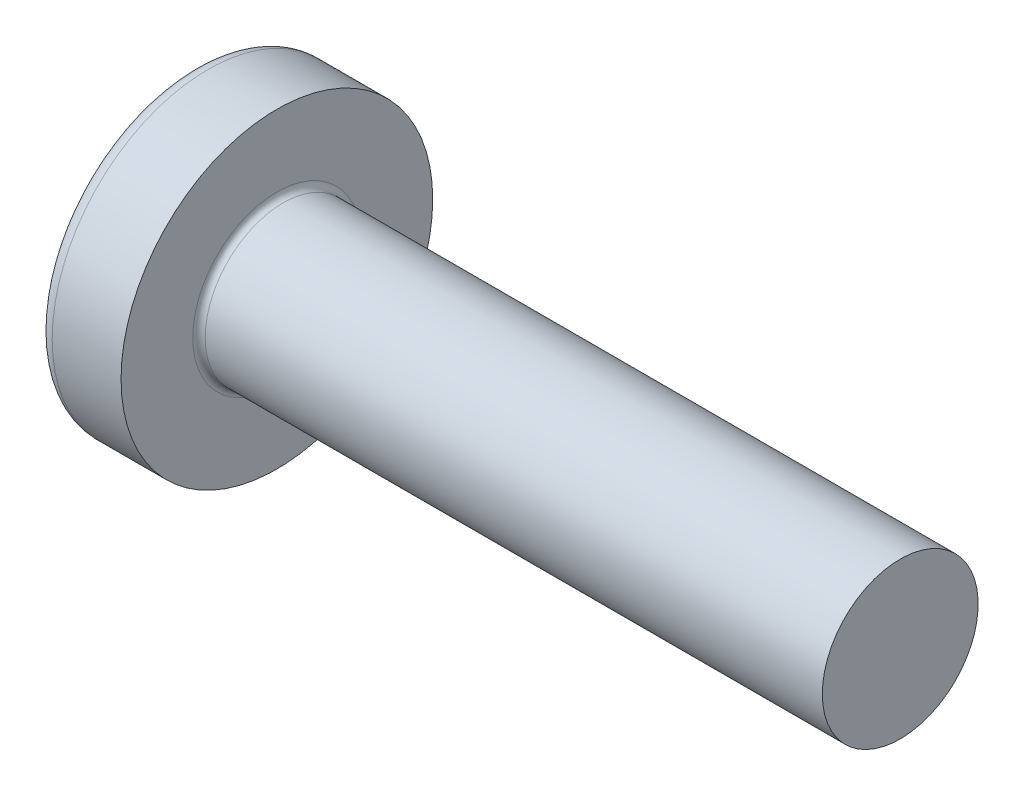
ISO-10303-21;
HEADER;
FILE_DESCRIPTION(('STEP AP214'),'2;1');
FILE_NAME('part.step','',(''),(''),'','','');
FILE_SCHEMA(('AUTOMOTIVE_DESIGN { 1 0 10303 214 1 1 1 1 }'));
ENDSEC;
DATA;
#1=APPLICATION_CONTEXT('core data for automotive mechanical design processes');
#2=APPLICATION_PROTOCOL_DEFINITION('international standard','automotive_design',2000,#1);
#3=PRODUCT_CONTEXT('',#1,'mechanical');
#4=PRODUCT('Part','Part','',(#3));
#5=PRODUCT_RELATED_PRODUCT_CATEGORY('part','',(#4));
#6=PRODUCT_DEFINITION_FORMATION('','',#4);
#7=PRODUCT_DEFINITION_CONTEXT('part definition',#1,'design');
#8=PRODUCT_DEFINITION('design','',#6,#7);
#9=PRODUCT_DEFINITION_SHAPE('','',#8);
#10=(LENGTH_UNIT() NAMED_UNIT(*) SI_UNIT(.MILLI.,.METRE.));
#11=(NAMED_UNIT(*) PLANE_ANGLE_UNIT() SI_UNIT($,.RADIAN.));
#12=(NAMED_UNIT(*) SI_UNIT($,.STERADIAN.) SOLID_ANGLE_UNIT());
#13=UNCERTAINTY_MEASURE_WITH_UNIT(LENGTH_MEASURE(1.E-05),#10,'distance_accuracy_value','');
#14=(GEOMETRIC_REPRESENTATION_CONTEXT(3) GLOBAL_UNCERTAINTY_ASSIGNED_CONTEXT((#13)) GLOBAL_UNIT_ASSIGNED_CONTEXT((#10,
#11,#12)) REPRESENTATION_CONTEXT('',''));
#15=CARTESIAN_POINT('',(0.,0.,0.));
#16=DIRECTION('',(0.,0.,1.));
#17=DIRECTION('',(1.,0.,0.));
#18=AXIS2_PLACEMENT_3D('',#15,#16,#17);
#19=CARTESIAN_POINT('',(4.,0.,0.));
#20=DIRECTION('',(-1.,0.,0.));
#21=DIRECTION('',(0.,1.,0.));
#22=AXIS2_PLACEMENT_3D('',#19,#20,#21);
#23=SPHERICAL_SURFACE('',#22,4.);
#24=CARTESIAN_POINT('',(0.803195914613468,0.,0.));
#25=DIRECTION('',(-1.,0.,0.));
#26=DIRECTION('',(0.,0.,1.));
#27=AXIS2_PLACEMENT_3D('',#24,#25,#26);
#28=CIRCLE('',#27,2.40425531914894);
#29=CARTESIAN_POINT('',(0.803195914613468,0.,2.40425531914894));
#30=VERTEX_POINT('',#29);
#31=EDGE_CURVE('E230',#30,#30,#28,.T.);
#32=ORIENTED_EDGE('',*,*,#31,.T.);
#33=EDGE_LOOP('',(#32));
#34=FACE_BOUND('',#33,.T.);
#35=CARTESIAN_POINT('',(0.0543400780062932,0.,0.));
#36=DIRECTION('',(1.,0.,0.));
#37=DIRECTION('',(0.,0.,-1.));
#38=AXIS2_PLACEMENT_3D('',#35,#36,#37);
#39=CIRCLE('',#38,0.657090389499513);
#40=CARTESIAN_POINT('',(0.0543400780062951,-0.369999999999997,-0.54301729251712));
#41=VERTEX_POINT('',#40);
#42=CARTESIAN_POINT('',(0.0543400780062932,-0.543017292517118,-0.37));
#43=VERTEX_POINT('',#42);
#44=EDGE_CURVE('E445',#41,#43,#39,.F.);
#45=ORIENTED_EDGE('',*,*,#44,.F.);
#46=CARTESIAN_POINT('',(4.,-0.37,0.));
#47=DIRECTION('',(0.,1.,0.));
#48=DIRECTION('',(0.,0.,1.));
#49=AXIS2_PLACEMENT_3D('',#46,#47,#48);
#50=CIRCLE('',#49,3.98285073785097);
#51=CARTESIAN_POINT('',(0.201999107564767,-0.369999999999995,-1.19928696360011));
#52=VERTEX_POINT('',#51);
#53=EDGE_CURVE('E277',#52,#41,#50,.T.);
#54=ORIENTED_EDGE('',*,*,#53,.F.);
#55=CARTESIAN_POINT('',(3.72274316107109,0.,0.556091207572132));
#56=DIRECTION('',(0.446197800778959,0.,-0.89493436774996));
#57=DIRECTION('',(-0.89493436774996,0.,-0.446197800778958));
#58=AXIS2_PLACEMENT_3D('',#55,#56,#57);
#59=CIRCLE('',#58,3.95144166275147);
#60=CARTESIAN_POINT('',(0.20199910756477,0.370000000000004,-1.19928696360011));
#61=VERTEX_POINT('',#60);
#62=EDGE_CURVE('E249',#52,#61,#59,.T.);
#63=ORIENTED_EDGE('',*,*,#62,.T.);
#64=CARTESIAN_POINT('',(4.,0.37,0.));
#65=DIRECTION('',(0.,-1.,0.));
#66=DIRECTION('',(0.,0.,-1.));
#67=AXIS2_PLACEMENT_3D('',#64,#65,#66);
#68=CIRCLE('',#67,3.98285073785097);
#69=CARTESIAN_POINT('',(0.0543400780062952,0.370000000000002,-0.543017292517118));
#70=VERTEX_POINT('',#69);
#71=EDGE_CURVE('E285',#70,#61,#68,.T.);
#72=ORIENTED_EDGE('',*,*,#71,.F.);
#73=CARTESIAN_POINT('',(0.0543400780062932,0.543017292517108,-0.37));
#74=VERTEX_POINT('',#73);
#75=EDGE_CURVE('E358',#74,#70,#39,.F.);
#76=ORIENTED_EDGE('',*,*,#75,.F.);
#77=CARTESIAN_POINT('',(4.,0.,-0.37));
#78=DIRECTION('',(0.,0.,1.));
#79=DIRECTION('',(0.,-1.,0.));
#80=AXIS2_PLACEMENT_3D('',#77,#78,#79);
#81=CIRCLE('',#80,3.98285073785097);
#82=CARTESIAN_POINT('',(0.201999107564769,1.19928696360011,-0.37));
#83=VERTEX_POINT('',#82);
#84=EDGE_CURVE('E243',#83,#74,#81,.T.);
#85=ORIENTED_EDGE('',*,*,#84,.F.);
#86=CARTESIAN_POINT('',(3.72274316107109,-0.556091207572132,0.));
#87=DIRECTION('',(0.446197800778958,0.89493436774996,0.));
#88=DIRECTION('',(-0.89493436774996,0.446197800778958,0.));
#89=AXIS2_PLACEMENT_3D('',#86,#87,#88);
#90=CIRCLE('',#89,3.95144166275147);
#91=CARTESIAN_POINT('',(0.201999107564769,1.19928696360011,0.369999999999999));
#92=VERTEX_POINT('',#91);
#93=EDGE_CURVE('E246',#83,#92,#90,.T.);
#94=ORIENTED_EDGE('',*,*,#93,.T.);
#95=CARTESIAN_POINT('',(4.,0.,0.37));
#96=DIRECTION('',(0.,0.,-1.));
#97=DIRECTION('',(0.,1.,0.));
#98=AXIS2_PLACEMENT_3D('',#95,#96,#97);
#99=CIRCLE('',#98,3.98285073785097);
#100=CARTESIAN_POINT('',(0.0543400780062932,0.543017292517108,0.37));
#101=VERTEX_POINT('',#100);
#102=EDGE_CURVE('E239',#101,#92,#99,.T.);
#103=ORIENTED_EDGE('',*,*,#102,.F.);
#104=CARTESIAN_POINT('',(0.0543400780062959,0.369999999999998,0.54301729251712));
#105=VERTEX_POINT('',#104);
#106=EDGE_CURVE('E391',#105,#101,#39,.F.);
#107=ORIENTED_EDGE('',*,*,#106,.F.);
#108=CARTESIAN_POINT('',(0.201999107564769,0.369999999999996,1.19928696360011));
#109=VERTEX_POINT('',#108);
#110=EDGE_CURVE('E259',#109,#105,#68,.T.);
#111=ORIENTED_EDGE('',*,*,#110,.F.);
#112=CARTESIAN_POINT('',(3.72274316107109,0.,-0.556091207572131));
#113=DIRECTION('',(0.446197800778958,0.,0.89493436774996));
#114=DIRECTION('',(0.89493436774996,0.,-0.446197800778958));
#115=AXIS2_PLACEMENT_3D('',#112,#113,#114);
#116=CIRCLE('',#115,3.95144166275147);
#117=CARTESIAN_POINT('',(0.201999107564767,-0.370000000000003,1.19928696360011));
#118=VERTEX_POINT('',#117);
#119=EDGE_CURVE('E41',#109,#118,#116,.T.);
#120=ORIENTED_EDGE('',*,*,#119,.T.);
#121=CARTESIAN_POINT('',(0.0543400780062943,-0.370000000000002,0.543017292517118));
#122=VERTEX_POINT('',#121);
#123=EDGE_CURVE('E256',#122,#118,#50,.T.);
#124=ORIENTED_EDGE('',*,*,#123,.F.);
#125=CARTESIAN_POINT('',(0.0543400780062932,-0.543017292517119,0.369999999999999));
#126=VERTEX_POINT('',#125);
#127=EDGE_CURVE('E430',#126,#122,#39,.F.);
#128=ORIENTED_EDGE('',*,*,#127,.F.);
#129=CARTESIAN_POINT('',(0.201999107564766,-1.19928696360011,0.369999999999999));
#130=VERTEX_POINT('',#129);
#131=EDGE_CURVE('E240',#130,#126,#99,.T.);
#132=ORIENTED_EDGE('',*,*,#131,.F.);
#133=CARTESIAN_POINT('',(3.72274316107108,0.556091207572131,0.));
#134=DIRECTION('',(0.446197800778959,-0.89493436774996,0.));
#135=DIRECTION('',(0.89493436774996,0.446197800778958,0.));
#136=AXIS2_PLACEMENT_3D('',#133,#134,#135);
#137=CIRCLE('',#136,3.95144166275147);
#138=CARTESIAN_POINT('',(0.201999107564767,-1.19928696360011,-0.37));
#139=VERTEX_POINT('',#138);
#140=EDGE_CURVE('E236',#130,#139,#137,.T.);
#141=ORIENTED_EDGE('',*,*,#140,.T.);
#142=EDGE_CURVE('E56',#43,#139,#81,.T.);
#143=ORIENTED_EDGE('',*,*,#142,.F.);
#144=EDGE_LOOP('',(#45,#54,#63,#72,#76,#85,#94,#103,#107,#111,#120,#124,#128,#132,#141,#143));
#145=FACE_BOUND('',#144,.T.);
#146=ADVANCED_FACE('F28',(#34,#145),#23,.T.);
#147=CARTESIAN_POINT('',(1.5,0.552127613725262,-0.37));
#148=DIRECTION('',(0.,0.,1.));
#149=DIRECTION('',(0.,-1.,0.));
#150=AXIS2_PLACEMENT_3D('',#147,#148,#149);
#151=PLANE('',#150);
#152=ORIENTED_EDGE('',*,*,#84,.T.);
#153=CARTESIAN_POINT('',(-0.984107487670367,0.628943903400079,-0.37));
#154=CARTESIAN_POINT('',(-0.783603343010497,0.61266994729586,-0.37));
#155=CARTESIAN_POINT('',(-0.583110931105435,0.596248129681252,-0.37));
#156=CARTESIAN_POINT('',(-0.182155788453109,0.562989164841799,-0.37));
#157=CARTESIAN_POINT('',(0.018306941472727,0.546152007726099,-0.37));
#158=CARTESIAN_POINT('',(0.419186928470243,0.511943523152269,-0.37));
#159=CARTESIAN_POINT('',(0.619604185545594,0.494572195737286,-0.37));
#160=CARTESIAN_POINT('',(1.02037173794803,0.459102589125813,-0.37));
#161=CARTESIAN_POINT('',(1.2207220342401,0.441004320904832,-0.37));
#162=CARTESIAN_POINT('',(1.53631168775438,0.411665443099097,-0.37));
#163=CARTESIAN_POINT('',(1.65158348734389,0.400774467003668,-0.37));
#164=CARTESIAN_POINT('',(1.88208360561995,0.378547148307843,-0.37));
#165=CARTESIAN_POINT('',(1.99731192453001,0.367210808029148,-0.37));
#166=CARTESIAN_POINT('',(2.22771614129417,0.343963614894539,-0.37));
#167=CARTESIAN_POINT('',(2.34289203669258,0.332052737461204,-0.37));
#168=CARTESIAN_POINT('',(2.57315819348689,0.307413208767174,-0.37));
#169=CARTESIAN_POINT('',(2.68824845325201,0.294684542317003,-0.37));
#170=CARTESIAN_POINT('',(2.80327961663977,0.281425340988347,-0.37));
#171=B_SPLINE_CURVE_WITH_KNOTS('',3,(#153,#154,#155,#156,#157,#158,#159,#160,#161,#162,#163,
#164,#165,#166,#167,#168,#169,#170),.UNSPECIFIED.,.F.,.F.,(4,2,2,2,2,2,2,2,4),(0.,
0.603490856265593,1.20699609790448,1.81050129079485,2.41399737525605,2.76135214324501,
3.1087051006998,3.45607293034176,3.80344721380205),.UNSPECIFIED.);
#172=CARTESIAN_POINT('',(1.5,0.415013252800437,-0.370000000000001));
#173=VERTEX_POINT('',#172);
#174=EDGE_CURVE('E351',#74,#173,#171,.T.);
#175=ORIENTED_EDGE('',*,*,#174,.T.);
#176=DIRECTION('',(0.,1.,0.));
#177=VECTOR('',#176,1.);
#178=CARTESIAN_POINT('',(1.5,-0.552127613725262,-0.37));
#179=LINE('',#178,#177);
#180=CARTESIAN_POINT('',(1.5,0.552127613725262,-0.37));
#181=VERTEX_POINT('',#180);
#182=EDGE_CURVE('E302',#173,#181,#179,.T.);
#183=ORIENTED_EDGE('',*,*,#182,.T.);
#184=DIRECTION('',(0.89493436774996,-0.446197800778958,0.));
#185=VECTOR('',#184,1.);
#186=CARTESIAN_POINT('',(0.,1.3,-0.37));
#187=LINE('',#186,#185);
#188=EDGE_CURVE('E308',#83,#181,#187,.T.);
#189=ORIENTED_EDGE('',*,*,#188,.F.);
#190=EDGE_LOOP('',(#152,#175,#183,#189));
#191=FACE_BOUND('',#190,.T.);
#192=ADVANCED_FACE('F186',(#191),#151,.T.);
#193=CARTESIAN_POINT('',(1.5,-0.552127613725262,-0.37));
#194=VERTEX_POINT('',#193);
#195=CARTESIAN_POINT('',(1.5,-0.415013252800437,-0.370000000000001));
#196=VERTEX_POINT('',#195);
#197=EDGE_CURVE('E299',#194,#196,#179,.T.);
#198=ORIENTED_EDGE('',*,*,#197,.T.);
#199=CARTESIAN_POINT('',(-0.984107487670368,-0.62894390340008,-0.37));
#200=CARTESIAN_POINT('',(-0.783603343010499,-0.61266994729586,-0.37));
#201=CARTESIAN_POINT('',(-0.583110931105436,-0.596248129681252,-0.37));
#202=CARTESIAN_POINT('',(-0.18215578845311,-0.562989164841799,-0.37));
#203=CARTESIAN_POINT('',(0.0183069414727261,-0.546152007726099,-0.37));
#204=CARTESIAN_POINT('',(0.419186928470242,-0.511943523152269,-0.37));
#205=CARTESIAN_POINT('',(0.619604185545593,-0.494572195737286,-0.37));
#206=CARTESIAN_POINT('',(1.02037173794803,-0.459102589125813,-0.37));
#207=CARTESIAN_POINT('',(1.22072203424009,-0.441004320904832,-0.37));
#208=CARTESIAN_POINT('',(1.53631168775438,-0.411665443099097,-0.37));
#209=CARTESIAN_POINT('',(1.65158348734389,-0.400774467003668,-0.37));
#210=CARTESIAN_POINT('',(1.88208360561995,-0.378547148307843,-0.37));
#211=CARTESIAN_POINT('',(1.99731192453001,-0.367210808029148,-0.37));
#212=CARTESIAN_POINT('',(2.22771614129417,-0.343963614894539,-0.37));
#213=CARTESIAN_POINT('',(2.34289203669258,-0.332052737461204,-0.37));
#214=CARTESIAN_POINT('',(2.57315819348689,-0.307413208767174,-0.37));
#215=CARTESIAN_POINT('',(2.68824845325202,-0.294684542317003,-0.37));
#216=CARTESIAN_POINT('',(2.80327961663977,-0.281425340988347,-0.37));
#217=B_SPLINE_CURVE_WITH_KNOTS('',3,(#199,#200,#201,#202,#203,#204,#205,#206,#207,#208,#209,
#210,#211,#212,#213,#214,#215,#216),.UNSPECIFIED.,.F.,.F.,(4,2,2,2,2,2,2,2,4),(0.,
0.603490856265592,1.20699609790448,1.81050129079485,2.41399737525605,2.76135214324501,
3.1087051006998,3.45607293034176,3.80344721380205),.UNSPECIFIED.);
#218=EDGE_CURVE('E344',#196,#43,#217,.F.);
#219=ORIENTED_EDGE('',*,*,#218,.T.);
#220=ORIENTED_EDGE('',*,*,#142,.T.);
#221=DIRECTION('',(0.89493436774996,0.446197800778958,0.));
#222=VECTOR('',#221,1.);
#223=CARTESIAN_POINT('',(0.,-1.3,-0.37));
#224=LINE('',#223,#222);
#225=EDGE_CURVE('E305',#139,#194,#224,.T.);
#226=ORIENTED_EDGE('',*,*,#225,.T.);
#227=EDGE_LOOP('',(#198,#219,#220,#226));
#228=FACE_BOUND('',#227,.T.);
#229=ADVANCED_FACE('F193',(#228),#151,.T.);
#230=CARTESIAN_POINT('',(1.5,-0.552127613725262,0.369999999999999));
#231=DIRECTION('',(0.,0.,-1.));
#232=DIRECTION('',(0.,1.,0.));
#233=AXIS2_PLACEMENT_3D('',#230,#231,#232);
#234=PLANE('',#233);
#235=DIRECTION('',(0.,-1.,0.));
#236=VECTOR('',#235,1.);
#237=CARTESIAN_POINT('',(1.5,0.552127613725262,0.37));
#238=LINE('',#237,#236);
#239=CARTESIAN_POINT('',(1.5,0.552127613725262,0.37));
#240=VERTEX_POINT('',#239);
#241=CARTESIAN_POINT('',(1.5,0.415013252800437,0.370000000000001));
#242=VERTEX_POINT('',#241);
#243=EDGE_CURVE('E291',#240,#242,#238,.T.);
#244=ORIENTED_EDGE('',*,*,#243,.T.);
#245=CARTESIAN_POINT('',(-0.984107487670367,0.62894390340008,0.37));
#246=CARTESIAN_POINT('',(-0.783603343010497,0.61266994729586,0.37));
#247=CARTESIAN_POINT('',(-0.583110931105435,0.596248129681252,0.37));
#248=CARTESIAN_POINT('',(-0.182155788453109,0.562989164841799,0.37));
#249=CARTESIAN_POINT('',(0.0183069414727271,0.546152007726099,0.37));
#250=CARTESIAN_POINT('',(0.419186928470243,0.511943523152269,0.37));
#251=CARTESIAN_POINT('',(0.619604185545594,0.494572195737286,0.37));
#252=CARTESIAN_POINT('',(1.02037173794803,0.459102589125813,0.37));
#253=CARTESIAN_POINT('',(1.2207220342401,0.441004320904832,0.37));
#254=CARTESIAN_POINT('',(1.53631168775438,0.411665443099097,0.37));
#255=CARTESIAN_POINT('',(1.65158348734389,0.400774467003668,0.37));
#256=CARTESIAN_POINT('',(1.88208360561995,0.378547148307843,0.37));
#257=CARTESIAN_POINT('',(1.99731192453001,0.367210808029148,0.37));
#258=CARTESIAN_POINT('',(2.22771614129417,0.343963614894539,0.37));
#259=CARTESIAN_POINT('',(2.34289203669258,0.332052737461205,0.37));
#260=CARTESIAN_POINT('',(2.57315819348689,0.307413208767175,0.37));
#261=CARTESIAN_POINT('',(2.68824845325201,0.294684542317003,0.37));
#262=CARTESIAN_POINT('',(2.80327961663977,0.281425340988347,0.37));
#263=B_SPLINE_CURVE_WITH_KNOTS('',3,(#245,#246,#247,#248,#249,#250,#251,#252,#253,#254,#255,
#256,#257,#258,#259,#260,#261,#262),.UNSPECIFIED.,.F.,.F.,(4,2,2,2,2,2,2,2,4),(0.,
0.603490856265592,1.20699609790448,1.81050129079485,2.41399737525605,2.76135214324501,
3.1087051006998,3.45607293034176,3.80344721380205),.UNSPECIFIED.);
#264=EDGE_CURVE('E392',#242,#101,#263,.F.);
#265=ORIENTED_EDGE('',*,*,#264,.T.);
#266=ORIENTED_EDGE('',*,*,#102,.T.);
#267=DIRECTION('',(0.89493436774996,-0.446197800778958,0.));
#268=VECTOR('',#267,1.);
#269=CARTESIAN_POINT('',(0.,1.3,0.37));
#270=LINE('',#269,#268);
#271=EDGE_CURVE('E307',#92,#240,#270,.T.);
#272=ORIENTED_EDGE('',*,*,#271,.T.);
#273=EDGE_LOOP('',(#244,#265,#266,#272));
#274=FACE_BOUND('',#273,.T.);
#275=ADVANCED_FACE('F339',(#274),#234,.T.);
#276=ORIENTED_EDGE('',*,*,#131,.T.);
#277=CARTESIAN_POINT('',(-0.984107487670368,-0.62894390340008,0.369999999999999));
#278=CARTESIAN_POINT('',(-0.783603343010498,-0.612669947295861,0.369999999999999));
#279=CARTESIAN_POINT('',(-0.583110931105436,-0.596248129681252,0.369999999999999));
#280=CARTESIAN_POINT('',(-0.18215578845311,-0.562989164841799,0.369999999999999));
#281=CARTESIAN_POINT('',(0.0183069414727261,-0.5461520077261,0.369999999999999));
#282=CARTESIAN_POINT('',(0.419186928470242,-0.511943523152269,0.369999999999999));
#283=CARTESIAN_POINT('',(0.619604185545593,-0.494572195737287,0.369999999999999));
#284=CARTESIAN_POINT('',(1.02037173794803,-0.459102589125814,0.369999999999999));
#285=CARTESIAN_POINT('',(1.22072203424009,-0.441004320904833,0.369999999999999));
#286=CARTESIAN_POINT('',(1.53631168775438,-0.411665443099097,0.369999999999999));
#287=CARTESIAN_POINT('',(1.65158348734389,-0.400774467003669,0.37));
#288=CARTESIAN_POINT('',(1.88208360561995,-0.378547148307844,0.37));
#289=CARTESIAN_POINT('',(1.99731192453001,-0.367210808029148,0.37));
#290=CARTESIAN_POINT('',(2.22771614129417,-0.34396361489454,0.37));
#291=CARTESIAN_POINT('',(2.34289203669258,-0.332052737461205,0.37));
#292=CARTESIAN_POINT('',(2.57315819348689,-0.307413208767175,0.37));
#293=CARTESIAN_POINT('',(2.68824845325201,-0.294684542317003,0.37));
#294=CARTESIAN_POINT('',(2.80327961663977,-0.281425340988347,0.37));
#295=B_SPLINE_CURVE_WITH_KNOTS('',3,(#277,#278,#279,#280,#281,#282,#283,#284,#285,#286,#287,
#288,#289,#290,#291,#292,#293,#294),.UNSPECIFIED.,.F.,.F.,(4,2,2,2,2,2,2,2,4),(0.,
0.603490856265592,1.20699609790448,1.81050129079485,2.41399737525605,2.76135214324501,
3.1087051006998,3.45607293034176,3.80344721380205),.UNSPECIFIED.);
#296=CARTESIAN_POINT('',(1.5,-0.415013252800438,0.37));
#297=VERTEX_POINT('',#296);
#298=EDGE_CURVE('E382',#126,#297,#295,.T.);
#299=ORIENTED_EDGE('',*,*,#298,.T.);
#300=CARTESIAN_POINT('',(1.5,-0.552127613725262,0.369999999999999));
#301=VERTEX_POINT('',#300);
#302=EDGE_CURVE('E294',#297,#301,#238,.T.);
#303=ORIENTED_EDGE('',*,*,#302,.T.);
#304=DIRECTION('',(0.89493436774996,0.446197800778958,0.));
#305=VECTOR('',#304,1.);
#306=CARTESIAN_POINT('',(0.,-1.3,0.369999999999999));
#307=LINE('',#306,#305);
#308=EDGE_CURVE('E289',#130,#301,#307,.T.);
#309=ORIENTED_EDGE('',*,*,#308,.F.);
#310=EDGE_LOOP('',(#276,#299,#303,#309));
#311=FACE_BOUND('',#310,.T.);
#312=ADVANCED_FACE('F335',(#311),#234,.T.);
#313=CARTESIAN_POINT('',(1.5,0.552127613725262,0.37));
#314=DIRECTION('',(0.446197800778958,0.89493436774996,0.));
#315=DIRECTION('',(-0.89493436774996,0.446197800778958,0.));
#316=AXIS2_PLACEMENT_3D('',#313,#314,#315);
#317=PLANE('',#316);
#318=CARTESIAN_POINT('',(2.47007520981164,0.0684659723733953,0.));
#319=DIRECTION('',(0.446197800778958,0.89493436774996,0.));
#320=DIRECTION('',(-0.89493436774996,0.446197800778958,0.));
#321=AXIS2_PLACEMENT_3D('',#318,#319,#320);
#322=ELLIPSE('',#321,1.09405678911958,0.483340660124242);
#323=CARTESIAN_POINT('',(1.5,0.552127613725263,0.0655064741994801));
#324=VERTEX_POINT('',#323);
#325=CARTESIAN_POINT('',(1.5,0.552127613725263,-0.0655064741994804));
#326=VERTEX_POINT('',#325);
#327=EDGE_CURVE('E422',#324,#326,#322,.F.);
#328=ORIENTED_EDGE('',*,*,#327,.F.);
#329=DIRECTION('',(0.,0.,-1.));
#330=VECTOR('',#329,1.);
#331=CARTESIAN_POINT('',(1.5,0.552127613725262,0.37));
#332=LINE('',#331,#330);
#333=EDGE_CURVE('E295',#240,#324,#332,.T.);
#334=ORIENTED_EDGE('',*,*,#333,.F.);
#335=ORIENTED_EDGE('',*,*,#271,.F.);
#336=ORIENTED_EDGE('',*,*,#93,.F.);
#337=ORIENTED_EDGE('',*,*,#188,.T.);
#338=EDGE_CURVE('E298',#326,#181,#332,.T.);
#339=ORIENTED_EDGE('',*,*,#338,.F.);
#340=EDGE_LOOP('',(#328,#334,#335,#336,#337,#339));
#341=FACE_BOUND('',#340,.T.);
#342=ADVANCED_FACE('F332',(#341),#317,.F.);
#343=CARTESIAN_POINT('',(0.,-1.3,-0.37));
#344=DIRECTION('',(0.446197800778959,-0.89493436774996,0.));
#345=DIRECTION('',(0.89493436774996,0.446197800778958,0.));
#346=AXIS2_PLACEMENT_3D('',#343,#344,#345);
#347=PLANE('',#346);
#348=CARTESIAN_POINT('',(2.47007520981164,-0.0684659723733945,0.));
#349=DIRECTION('',(0.446197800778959,-0.89493436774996,0.));
#350=DIRECTION('',(-0.89493436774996,-0.446197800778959,0.));
#351=AXIS2_PLACEMENT_3D('',#348,#349,#350);
#352=ELLIPSE('',#351,1.09405678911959,0.483340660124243);
#353=CARTESIAN_POINT('',(1.5,-0.552127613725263,-0.0655064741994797));
#354=VERTEX_POINT('',#353);
#355=CARTESIAN_POINT('',(1.5,-0.552127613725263,0.0655064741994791));
#356=VERTEX_POINT('',#355);
#357=EDGE_CURVE('E418',#354,#356,#352,.F.);
#358=ORIENTED_EDGE('',*,*,#357,.F.);
#359=DIRECTION('',(0.,0.,1.));
#360=VECTOR('',#359,1.);
#361=CARTESIAN_POINT('',(1.5,-0.552127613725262,-0.37));
#362=LINE('',#361,#360);
#363=EDGE_CURVE('E286',#194,#354,#362,.T.);
#364=ORIENTED_EDGE('',*,*,#363,.F.);
#365=ORIENTED_EDGE('',*,*,#225,.F.);
#366=ORIENTED_EDGE('',*,*,#140,.F.);
#367=ORIENTED_EDGE('',*,*,#308,.T.);
#368=EDGE_CURVE('E290',#356,#301,#362,.T.);
#369=ORIENTED_EDGE('',*,*,#368,.F.);
#370=EDGE_LOOP('',(#358,#364,#365,#366,#367,#369));
#371=FACE_BOUND('',#370,.T.);
#372=ADVANCED_FACE('F334',(#371),#347,.F.);
#373=CARTESIAN_POINT('',(1.5,0.552127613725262,-0.37));
#374=DIRECTION('',(-1.,0.,0.));
#375=DIRECTION('',(0.,0.,1.));
#376=AXIS2_PLACEMENT_3D('',#373,#374,#375);
#377=PLANE('',#376);
#378=DIRECTION('',(0.,1.,0.));
#379=VECTOR('',#378,1.);
#380=CARTESIAN_POINT('',(1.5,-0.370000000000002,0.55212761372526));
#381=LINE('',#380,#379);
#382=CARTESIAN_POINT('',(1.5,-0.370000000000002,0.55212761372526));
#383=VERTEX_POINT('',#382);
#384=CARTESIAN_POINT('',(1.5,-0.0655064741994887,0.552127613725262));
#385=VERTEX_POINT('',#384);
#386=EDGE_CURVE('E486',#383,#385,#381,.T.);
#387=ORIENTED_EDGE('',*,*,#386,.T.);
#388=CARTESIAN_POINT('',(1.5,0.,0.));
#389=DIRECTION('',(-1.,0.,0.));
#390=DIRECTION('',(0.,0.,1.));
#391=AXIS2_PLACEMENT_3D('',#388,#389,#390);
#392=CIRCLE('',#391,0.556);
#393=CARTESIAN_POINT('',(1.5,-0.370000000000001,0.415013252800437));
#394=VERTEX_POINT('',#393);
#395=EDGE_CURVE('E443',#394,#385,#392,.T.);
#396=ORIENTED_EDGE('',*,*,#395,.F.);
#397=DIRECTION('',(0.,0.,-1.));
#398=VECTOR('',#397,1.);
#399=CARTESIAN_POINT('',(1.5,-0.370000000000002,0.55212761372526));
#400=LINE('',#399,#398);
#401=EDGE_CURVE('E481',#383,#394,#400,.T.);
#402=ORIENTED_EDGE('',*,*,#401,.F.);
#403=EDGE_LOOP('',(#387,#396,#402));
#404=FACE_BOUND('',#403,.T.);
#405=ADVANCED_FACE('F407',(#404),#377,.T.);
#406=ORIENTED_EDGE('',*,*,#302,.F.);
#407=EDGE_CURVE('E438',#356,#297,#392,.T.);
#408=ORIENTED_EDGE('',*,*,#407,.F.);
#409=ORIENTED_EDGE('',*,*,#368,.T.);
#410=EDGE_LOOP('',(#406,#408,#409));
#411=FACE_BOUND('',#410,.T.);
#412=ADVANCED_FACE('F409',(#411),#377,.T.);
#413=ORIENTED_EDGE('',*,*,#363,.T.);
#414=EDGE_CURVE('E427',#196,#354,#392,.T.);
#415=ORIENTED_EDGE('',*,*,#414,.F.);
#416=ORIENTED_EDGE('',*,*,#197,.F.);
#417=EDGE_LOOP('',(#413,#415,#416));
#418=FACE_BOUND('',#417,.T.);
#419=ADVANCED_FACE('F425',(#418),#377,.T.);
#420=CARTESIAN_POINT('',(1.5,-0.369999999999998,-0.415013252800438));
#421=VERTEX_POINT('',#420);
#422=CARTESIAN_POINT('',(1.5,-0.369999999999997,-0.552127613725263));
#423=VERTEX_POINT('',#422);
#424=EDGE_CURVE('E475',#421,#423,#400,.T.);
#425=ORIENTED_EDGE('',*,*,#424,.F.);
#426=CARTESIAN_POINT('',(1.5,-0.0655064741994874,-0.552127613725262));
#427=VERTEX_POINT('',#426);
#428=EDGE_CURVE('E48',#427,#421,#392,.T.);
#429=ORIENTED_EDGE('',*,*,#428,.F.);
#430=DIRECTION('',(0.,-1.,0.));
#431=VECTOR('',#430,1.);
#432=CARTESIAN_POINT('',(1.5,0.370000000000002,-0.55212761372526));
#433=LINE('',#432,#431);
#434=EDGE_CURVE('E473',#427,#423,#433,.T.);
#435=ORIENTED_EDGE('',*,*,#434,.T.);
#436=EDGE_LOOP('',(#425,#429,#435));
#437=FACE_BOUND('',#436,.T.);
#438=ADVANCED_FACE('F472',(#437),#377,.T.);
#439=CARTESIAN_POINT('',(1.5,0.370000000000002,-0.55212761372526));
#440=VERTEX_POINT('',#439);
#441=CARTESIAN_POINT('',(1.5,0.0655064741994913,-0.552127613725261));
#442=VERTEX_POINT('',#441);
#443=EDGE_CURVE('E480',#440,#442,#433,.T.);
#444=ORIENTED_EDGE('',*,*,#443,.T.);
#445=CARTESIAN_POINT('',(1.5,0.370000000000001,-0.415013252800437));
#446=VERTEX_POINT('',#445);
#447=EDGE_CURVE('E469',#446,#442,#392,.T.);
#448=ORIENTED_EDGE('',*,*,#447,.F.);
#449=DIRECTION('',(0.,0.,1.));
#450=VECTOR('',#449,1.);
#451=CARTESIAN_POINT('',(1.5,0.370000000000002,-0.55212761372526));
#452=LINE('',#451,#450);
#453=EDGE_CURVE('E490',#440,#446,#452,.T.);
#454=ORIENTED_EDGE('',*,*,#453,.F.);
#455=EDGE_LOOP('',(#444,#448,#454));
#456=FACE_BOUND('',#455,.T.);
#457=ADVANCED_FACE('F497',(#456),#377,.T.);
#458=ORIENTED_EDGE('',*,*,#182,.F.);
#459=EDGE_CURVE('E499',#326,#173,#392,.T.);
#460=ORIENTED_EDGE('',*,*,#459,.F.);
#461=ORIENTED_EDGE('',*,*,#338,.T.);
#462=EDGE_LOOP('',(#458,#460,#461));
#463=FACE_BOUND('',#462,.T.);
#464=ADVANCED_FACE('F525',(#463),#377,.T.);
#465=ORIENTED_EDGE('',*,*,#333,.T.);
#466=EDGE_CURVE('E504',#242,#324,#392,.T.);
#467=ORIENTED_EDGE('',*,*,#466,.F.);
#468=ORIENTED_EDGE('',*,*,#243,.F.);
#469=EDGE_LOOP('',(#465,#467,#468));
#470=FACE_BOUND('',#469,.T.);
#471=ADVANCED_FACE('F513',(#470),#377,.T.);
#472=CARTESIAN_POINT('',(1.5,0.369999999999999,0.415013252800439));
#473=VERTEX_POINT('',#472);
#474=CARTESIAN_POINT('',(1.5,0.369999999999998,0.552127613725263));
#475=VERTEX_POINT('',#474);
#476=EDGE_CURVE('E274',#473,#475,#452,.T.);
#477=ORIENTED_EDGE('',*,*,#476,.F.);
#478=CARTESIAN_POINT('',(1.5,0.0655064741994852,0.552127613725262));
#479=VERTEX_POINT('',#478);
#480=EDGE_CURVE('E444',#479,#473,#392,.T.);
#481=ORIENTED_EDGE('',*,*,#480,.F.);
#482=EDGE_CURVE('E489',#479,#475,#381,.T.);
#483=ORIENTED_EDGE('',*,*,#482,.T.);
#484=EDGE_LOOP('',(#477,#481,#483));
#485=FACE_BOUND('',#484,.T.);
#486=ADVANCED_FACE('F401',(#485),#377,.T.);
#487=CARTESIAN_POINT('',(1.5,0.369999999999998,0.552127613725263));
#488=DIRECTION('',(0.,-1.,0.));
#489=DIRECTION('',(0.,0.,-1.));
#490=AXIS2_PLACEMENT_3D('',#487,#488,#489);
#491=PLANE('',#490);
#492=ORIENTED_EDGE('',*,*,#110,.T.);
#493=CARTESIAN_POINT('',(-0.984107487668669,0.369999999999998,0.628943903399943));
#494=CARTESIAN_POINT('',(-0.783603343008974,0.369999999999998,0.612669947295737));
#495=CARTESIAN_POINT('',(-0.583110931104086,0.369999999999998,0.596248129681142));
#496=CARTESIAN_POINT('',(-0.182155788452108,0.369999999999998,0.562989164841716));
#497=CARTESIAN_POINT('',(0.0183069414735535,0.369999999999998,0.546152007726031));
#498=CARTESIAN_POINT('',(0.419186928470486,0.369999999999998,0.511943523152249));
#499=CARTESIAN_POINT('',(0.61960418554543,0.369999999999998,0.494572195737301));
#500=CARTESIAN_POINT('',(1.02037173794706,0.369999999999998,0.459102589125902));
#501=CARTESIAN_POINT('',(1.22072203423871,0.369999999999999,0.441004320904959));
#502=CARTESIAN_POINT('',(1.53631168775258,0.369999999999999,0.411665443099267));
#503=CARTESIAN_POINT('',(1.65158348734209,0.369999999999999,0.40077446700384));
#504=CARTESIAN_POINT('',(1.88208360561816,0.369999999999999,0.378547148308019));
#505=CARTESIAN_POINT('',(1.99731192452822,0.369999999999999,0.367210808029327));
#506=CARTESIAN_POINT('',(2.22771614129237,0.369999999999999,0.343963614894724));
#507=CARTESIAN_POINT('',(2.34289203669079,0.369999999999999,0.332052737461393));
#508=CARTESIAN_POINT('',(2.5731581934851,0.369999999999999,0.307413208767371));
#509=CARTESIAN_POINT('',(2.68824845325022,0.369999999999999,0.294684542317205));
#510=CARTESIAN_POINT('',(2.80327961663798,0.369999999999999,0.281425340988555));
#511=B_SPLINE_CURVE_WITH_KNOTS('',3,(#493,#494,#495,#496,#497,#498,#499,#500,#501,#502,#503,
#504,#505,#506,#507,#508,#509,#510),.UNSPECIFIED.,.F.,.F.,(4,2,2,2,2,2,2,2,4),(0.,
0.603490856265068,1.20699609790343,1.81050129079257,2.41399737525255,2.7613521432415,
3.1087051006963,3.45607293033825,3.80344721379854),.UNSPECIFIED.);
#512=EDGE_CURVE('E387',#105,#473,#511,.T.);
#513=ORIENTED_EDGE('',*,*,#512,.T.);
#514=ORIENTED_EDGE('',*,*,#476,.T.);
#515=DIRECTION('',(0.89493436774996,0.,-0.446197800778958));
#516=VECTOR('',#515,1.);
#517=CARTESIAN_POINT('',(0.,0.369999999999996,1.3));
#518=LINE('',#517,#516);
#519=EDGE_CURVE('E267',#109,#475,#518,.T.);
#520=ORIENTED_EDGE('',*,*,#519,.F.);
#521=EDGE_LOOP('',(#492,#513,#514,#520));
#522=FACE_BOUND('',#521,.T.);
#523=ADVANCED_FACE('F271',(#522),#491,.T.);
#524=CARTESIAN_POINT('',(1.5,-0.369999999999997,-0.552127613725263));
#525=DIRECTION('',(0.,1.,0.));
#526=DIRECTION('',(0.,0.,1.));
#527=AXIS2_PLACEMENT_3D('',#524,#525,#526);
#528=PLANE('',#527);
#529=ORIENTED_EDGE('',*,*,#401,.T.);
#530=CARTESIAN_POINT('',(-0.984107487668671,-0.370000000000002,0.628943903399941));
#531=CARTESIAN_POINT('',(-0.783603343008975,-0.370000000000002,0.612669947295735));
#532=CARTESIAN_POINT('',(-0.583110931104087,-0.370000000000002,0.59624812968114));
#533=CARTESIAN_POINT('',(-0.18215578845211,-0.370000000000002,0.562989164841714));
#534=CARTESIAN_POINT('',(0.0183069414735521,-0.370000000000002,0.546152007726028));
#535=CARTESIAN_POINT('',(0.419186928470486,-0.370000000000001,0.511943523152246));
#536=CARTESIAN_POINT('',(0.619604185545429,-0.370000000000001,0.494572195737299));
#537=CARTESIAN_POINT('',(1.02037173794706,-0.370000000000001,0.459102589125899));
#538=CARTESIAN_POINT('',(1.22072203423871,-0.370000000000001,0.441004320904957));
#539=CARTESIAN_POINT('',(1.53631168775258,-0.370000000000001,0.411665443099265));
#540=CARTESIAN_POINT('',(1.65158348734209,-0.370000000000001,0.400774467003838));
#541=CARTESIAN_POINT('',(1.88208360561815,-0.370000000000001,0.378547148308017));
#542=CARTESIAN_POINT('',(1.99731192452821,-0.370000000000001,0.367210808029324));
#543=CARTESIAN_POINT('',(2.22771614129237,-0.370000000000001,0.343963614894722));
#544=CARTESIAN_POINT('',(2.34289203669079,-0.370000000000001,0.332052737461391));
#545=CARTESIAN_POINT('',(2.5731581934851,-0.370000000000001,0.307413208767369));
#546=CARTESIAN_POINT('',(2.68824845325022,-0.370000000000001,0.294684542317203));
#547=CARTESIAN_POINT('',(2.80327961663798,-0.370000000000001,0.281425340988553));
#548=B_SPLINE_CURVE_WITH_KNOTS('',3,(#530,#531,#532,#533,#534,#535,#536,#537,#538,#539,#540,
#541,#542,#543,#544,#545,#546,#547),.UNSPECIFIED.,.F.,.F.,(4,2,2,2,2,2,2,2,4),(0.,
0.603490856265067,1.20699609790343,1.81050129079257,2.41399737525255,2.7613521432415,
3.1087051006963,3.45607293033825,3.80344721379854),.UNSPECIFIED.);
#549=EDGE_CURVE('E377',#394,#122,#548,.F.);
#550=ORIENTED_EDGE('',*,*,#549,.T.);
#551=ORIENTED_EDGE('',*,*,#123,.T.);
#552=DIRECTION('',(0.89493436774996,0.,-0.446197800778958));
#553=VECTOR('',#552,1.);
#554=CARTESIAN_POINT('',(0.,-0.370000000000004,1.3));
#555=LINE('',#554,#553);
#556=EDGE_CURVE('E269',#118,#383,#555,.T.);
#557=ORIENTED_EDGE('',*,*,#556,.T.);
#558=EDGE_LOOP('',(#529,#550,#551,#557));
#559=FACE_BOUND('',#558,.T.);
#560=ADVANCED_FACE('F400',(#559),#528,.T.);
#561=CARTESIAN_POINT('',(1.5,-0.370000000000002,0.55212761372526));
#562=DIRECTION('',(0.446197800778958,0.,0.89493436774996));
#563=DIRECTION('',(-0.89493436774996,0.,0.446197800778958));
#564=AXIS2_PLACEMENT_3D('',#561,#562,#563);
#565=PLANE('',#564);
#566=CARTESIAN_POINT('',(2.47007520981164,0.,0.0684659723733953));
#567=DIRECTION('',(0.446197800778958,0.,0.89493436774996));
#568=DIRECTION('',(-0.89493436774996,0.,0.446197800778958));
#569=AXIS2_PLACEMENT_3D('',#566,#567,#568);
#570=ELLIPSE('',#569,1.09405678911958,0.483340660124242);
#571=EDGE_CURVE('E453',#385,#479,#570,.F.);
#572=ORIENTED_EDGE('',*,*,#571,.F.);
#573=ORIENTED_EDGE('',*,*,#386,.F.);
#574=ORIENTED_EDGE('',*,*,#556,.F.);
#575=ORIENTED_EDGE('',*,*,#119,.F.);
#576=ORIENTED_EDGE('',*,*,#519,.T.);
#577=ORIENTED_EDGE('',*,*,#482,.F.);
#578=EDGE_LOOP('',(#572,#573,#574,#575,#576,#577));
#579=FACE_BOUND('',#578,.T.);
#580=ADVANCED_FACE('F265',(#579),#565,.F.);
#581=CARTESIAN_POINT('',(0.,0.370000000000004,-1.3));
#582=DIRECTION('',(0.446197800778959,0.,-0.89493436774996));
#583=DIRECTION('',(0.89493436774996,0.,0.446197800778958));
#584=AXIS2_PLACEMENT_3D('',#581,#582,#583);
#585=PLANE('',#584);
#586=CARTESIAN_POINT('',(2.47007520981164,0.,-0.0684659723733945));
#587=DIRECTION('',(0.446197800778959,0.,-0.89493436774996));
#588=DIRECTION('',(-0.89493436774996,0.,-0.446197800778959));
#589=AXIS2_PLACEMENT_3D('',#586,#587,#588);
#590=ELLIPSE('',#589,1.09405678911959,0.483340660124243);
#591=EDGE_CURVE('E357',#442,#427,#590,.F.);
#592=ORIENTED_EDGE('',*,*,#591,.F.);
#593=ORIENTED_EDGE('',*,*,#443,.F.);
#594=DIRECTION('',(0.89493436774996,0.,0.446197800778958));
#595=VECTOR('',#594,1.);
#596=CARTESIAN_POINT('',(0.,0.370000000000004,-1.3));
#597=LINE('',#596,#595);
#598=EDGE_CURVE('E279',#61,#440,#597,.T.);
#599=ORIENTED_EDGE('',*,*,#598,.F.);
#600=ORIENTED_EDGE('',*,*,#62,.F.);
#601=DIRECTION('',(0.89493436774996,0.,0.446197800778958));
#602=VECTOR('',#601,1.);
#603=CARTESIAN_POINT('',(0.,-0.369999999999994,-1.3));
#604=LINE('',#603,#602);
#605=EDGE_CURVE('E479',#52,#423,#604,.T.);
#606=ORIENTED_EDGE('',*,*,#605,.T.);
#607=ORIENTED_EDGE('',*,*,#434,.F.);
#608=EDGE_LOOP('',(#592,#593,#599,#600,#606,#607));
#609=FACE_BOUND('',#608,.T.);
#610=ADVANCED_FACE('F367',(#609),#585,.F.);
#611=ORIENTED_EDGE('',*,*,#453,.T.);
#612=CARTESIAN_POINT('',(-0.98410748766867,0.370000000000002,-0.628943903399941));
#613=CARTESIAN_POINT('',(-0.783603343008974,0.370000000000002,-0.612669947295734));
#614=CARTESIAN_POINT('',(-0.583110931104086,0.370000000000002,-0.59624812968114));
#615=CARTESIAN_POINT('',(-0.182155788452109,0.370000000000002,-0.562989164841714));
#616=CARTESIAN_POINT('',(0.0183069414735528,0.370000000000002,-0.546152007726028));
#617=CARTESIAN_POINT('',(0.419186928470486,0.370000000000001,-0.511943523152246));
#618=CARTESIAN_POINT('',(0.61960418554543,0.370000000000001,-0.494572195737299));
#619=CARTESIAN_POINT('',(1.02037173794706,0.370000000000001,-0.459102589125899));
#620=CARTESIAN_POINT('',(1.22072203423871,0.370000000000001,-0.441004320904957));
#621=CARTESIAN_POINT('',(1.53631168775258,0.370000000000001,-0.411665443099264));
#622=CARTESIAN_POINT('',(1.65158348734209,0.370000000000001,-0.400774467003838));
#623=CARTESIAN_POINT('',(1.88208360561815,0.370000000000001,-0.378547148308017));
#624=CARTESIAN_POINT('',(1.99731192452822,0.370000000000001,-0.367210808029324));
#625=CARTESIAN_POINT('',(2.22771614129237,0.370000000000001,-0.343963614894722));
#626=CARTESIAN_POINT('',(2.34289203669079,0.370000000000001,-0.332052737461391));
#627=CARTESIAN_POINT('',(2.5731581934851,0.370000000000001,-0.307413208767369));
#628=CARTESIAN_POINT('',(2.68824845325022,0.370000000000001,-0.294684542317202));
#629=CARTESIAN_POINT('',(2.80327961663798,0.370000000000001,-0.281425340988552));
#630=B_SPLINE_CURVE_WITH_KNOTS('',3,(#612,#613,#614,#615,#616,#617,#618,#619,#620,#621,#622,
#623,#624,#625,#626,#627,#628,#629),.UNSPECIFIED.,.F.,.F.,(4,2,2,2,2,2,2,2,4),(0.,
0.603490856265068,1.20699609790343,1.81050129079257,2.41399737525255,2.7613521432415,
3.1087051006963,3.45607293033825,3.80344721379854),.UNSPECIFIED.);
#631=EDGE_CURVE('E359',#446,#70,#630,.F.);
#632=ORIENTED_EDGE('',*,*,#631,.T.);
#633=ORIENTED_EDGE('',*,*,#71,.T.);
#634=ORIENTED_EDGE('',*,*,#598,.T.);
#635=EDGE_LOOP('',(#611,#632,#633,#634));
#636=FACE_BOUND('',#635,.T.);
#637=ADVANCED_FACE('F402',(#636),#491,.T.);
#638=ORIENTED_EDGE('',*,*,#53,.T.);
#639=CARTESIAN_POINT('',(-0.98410748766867,-0.369999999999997,-0.628943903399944));
#640=CARTESIAN_POINT('',(-0.783603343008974,-0.369999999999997,-0.612669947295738));
#641=CARTESIAN_POINT('',(-0.583110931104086,-0.369999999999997,-0.596248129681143));
#642=CARTESIAN_POINT('',(-0.182155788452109,-0.369999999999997,-0.562989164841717));
#643=CARTESIAN_POINT('',(0.0183069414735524,-0.369999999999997,-0.546152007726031));
#644=CARTESIAN_POINT('',(0.419186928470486,-0.369999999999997,-0.511943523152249));
#645=CARTESIAN_POINT('',(0.619604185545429,-0.369999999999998,-0.494572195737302));
#646=CARTESIAN_POINT('',(1.02037173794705,-0.369999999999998,-0.459102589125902));
#647=CARTESIAN_POINT('',(1.22072203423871,-0.369999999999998,-0.44100432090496));
#648=CARTESIAN_POINT('',(1.53631168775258,-0.369999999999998,-0.411665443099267));
#649=CARTESIAN_POINT('',(1.65158348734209,-0.369999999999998,-0.400774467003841));
#650=CARTESIAN_POINT('',(1.88208360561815,-0.369999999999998,-0.37854714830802));
#651=CARTESIAN_POINT('',(1.99731192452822,-0.369999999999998,-0.367210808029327));
#652=CARTESIAN_POINT('',(2.22771614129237,-0.369999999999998,-0.343963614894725));
#653=CARTESIAN_POINT('',(2.34289203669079,-0.369999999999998,-0.332052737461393));
#654=CARTESIAN_POINT('',(2.5731581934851,-0.369999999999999,-0.307413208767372));
#655=CARTESIAN_POINT('',(2.68824845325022,-0.369999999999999,-0.294684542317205));
#656=CARTESIAN_POINT('',(2.80327961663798,-0.369999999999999,-0.281425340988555));
#657=B_SPLINE_CURVE_WITH_KNOTS('',3,(#639,#640,#641,#642,#643,#644,#645,#646,#647,#648,#649,
#650,#651,#652,#653,#654,#655,#656),.UNSPECIFIED.,.F.,.F.,(4,2,2,2,2,2,2,2,4),(0.,
0.603490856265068,1.20699609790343,1.81050129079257,2.41399737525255,2.7613521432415,
3.1087051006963,3.45607293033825,3.80344721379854),.UNSPECIFIED.);
#658=EDGE_CURVE('E11',#41,#421,#657,.T.);
#659=ORIENTED_EDGE('',*,*,#658,.T.);
#660=ORIENTED_EDGE('',*,*,#424,.T.);
#661=ORIENTED_EDGE('',*,*,#605,.F.);
#662=EDGE_LOOP('',(#638,#659,#660,#661));
#663=FACE_BOUND('',#662,.T.);
#664=ADVANCED_FACE('F216',(#663),#528,.T.);
#665=CARTESIAN_POINT('',(-25.4,0.,0.));
#666=DIRECTION('',(-1.,0.,0.));
#667=DIRECTION('',(0.,0.,1.));
#668=AXIS2_PLACEMENT_3D('',#665,#666,#667);
#669=CYLINDRICAL_SURFACE('',#668,1.25);
#670=CARTESIAN_POINT('',(2.2,0.,0.));
#671=DIRECTION('',(-1.,0.,0.));
#672=DIRECTION('',(0.,0.,1.));
#673=AXIS2_PLACEMENT_3D('',#670,#671,#672);
#674=CIRCLE('',#673,1.25);
#675=CARTESIAN_POINT('',(2.2,0.,1.25));
#676=VERTEX_POINT('',#675);
#677=EDGE_CURVE('E227',#676,#676,#674,.F.);
#678=ORIENTED_EDGE('',*,*,#677,.T.);
#679=EDGE_LOOP('',(#678));
#680=FACE_BOUND('',#679,.T.);
#681=CARTESIAN_POINT('',(12.1,0.,0.));
#682=DIRECTION('',(-1.,0.,0.));
#683=DIRECTION('',(0.,0.,1.));
#684=AXIS2_PLACEMENT_3D('',#681,#682,#683);
#685=CIRCLE('',#684,1.25);
#686=CARTESIAN_POINT('',(12.1,0.,1.25));
#687=VERTEX_POINT('',#686);
#688=EDGE_CURVE('E311',#687,#687,#685,.T.);
#689=ORIENTED_EDGE('',*,*,#688,.T.);
#690=EDGE_LOOP('',(#689));
#691=FACE_BOUND('',#690,.T.);
#692=ADVANCED_FACE('F30',(#680,#691),#669,.T.);
#693=CARTESIAN_POINT('',(2.1,1.25,0.));
#694=DIRECTION('',(-1.,0.,0.));
#695=DIRECTION('',(0.,0.,1.));
#696=AXIS2_PLACEMENT_3D('',#693,#694,#695);
#697=PLANE('',#696);
#698=CARTESIAN_POINT('',(2.1,0.,0.));
#699=DIRECTION('',(-1.,0.,0.));
#700=DIRECTION('',(0.,0.,1.));
#701=AXIS2_PLACEMENT_3D('',#698,#699,#700);
#702=CIRCLE('',#701,1.35);
#703=CARTESIAN_POINT('',(2.1,0.,1.35));
#704=VERTEX_POINT('',#703);
#705=EDGE_CURVE('E221',#704,#704,#702,.T.);
#706=ORIENTED_EDGE('',*,*,#705,.T.);
#707=EDGE_LOOP('',(#706));
#708=FACE_BOUND('',#707,.T.);
#709=CARTESIAN_POINT('',(2.1,0.,0.));
#710=DIRECTION('',(-1.,0.,0.));
#711=DIRECTION('',(0.,0.,1.));
#712=AXIS2_PLACEMENT_3D('',#709,#710,#711);
#713=CIRCLE('',#712,2.5);
#714=CARTESIAN_POINT('',(2.1,0.,2.5));
#715=VERTEX_POINT('',#714);
#716=EDGE_CURVE('E224',#715,#715,#713,.T.);
#717=ORIENTED_EDGE('',*,*,#716,.F.);
#718=EDGE_LOOP('',(#717));
#719=FACE_BOUND('',#718,.T.);
#720=ADVANCED_FACE('F208',(#708,#719),#697,.F.);
#721=CARTESIAN_POINT('',(-25.4,0.,0.));
#722=DIRECTION('',(-1.,0.,0.));
#723=DIRECTION('',(0.,0.,1.));
#724=AXIS2_PLACEMENT_3D('',#721,#722,#723);
#725=CYLINDRICAL_SURFACE('',#724,2.5);
#726=ORIENTED_EDGE('',*,*,#716,.T.);
#727=EDGE_LOOP('',(#726));
#728=FACE_BOUND('',#727,.T.);
#729=CARTESIAN_POINT('',(0.995004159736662,0.,0.));
#730=DIRECTION('',(-1.,0.,0.));
#731=DIRECTION('',(0.,0.,1.));
#732=AXIS2_PLACEMENT_3D('',#729,#730,#731);
#733=CIRCLE('',#732,2.5);
#734=CARTESIAN_POINT('',(0.995004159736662,0.,2.5));
#735=VERTEX_POINT('',#734);
#736=EDGE_CURVE('E225',#735,#735,#733,.T.);
#737=ORIENTED_EDGE('',*,*,#736,.F.);
#738=EDGE_LOOP('',(#737));
#739=FACE_BOUND('',#738,.T.);
#740=ADVANCED_FACE('F205',(#728,#739),#725,.T.);
#741=CARTESIAN_POINT('',(0.995004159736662,0.,0.));
#742=DIRECTION('',(-1.,0.,0.));
#743=DIRECTION('',(0.,0.,1.));
#744=AXIS2_PLACEMENT_3D('',#741,#742,#743);
#745=TOROIDAL_SURFACE('',#744,2.26,0.24);
#746=ORIENTED_EDGE('',*,*,#736,.T.);
#747=EDGE_LOOP('',(#746));
#748=FACE_BOUND('',#747,.T.);
#749=ORIENTED_EDGE('',*,*,#31,.F.);
#750=EDGE_LOOP('',(#749));
#751=FACE_BOUND('',#750,.T.);
#752=ADVANCED_FACE('F202',(#748,#751),#745,.T.);
#753=CARTESIAN_POINT('',(12.1,1.25,0.));
#754=DIRECTION('',(1.,0.,0.));
#755=DIRECTION('',(0.,0.,-1.));
#756=AXIS2_PLACEMENT_3D('',#753,#754,#755);
#757=PLANE('',#756);
#758=ORIENTED_EDGE('',*,*,#688,.F.);
#759=EDGE_LOOP('',(#758));
#760=FACE_BOUND('',#759,.T.);
#761=ADVANCED_FACE('F200',(#760),#757,.T.);
#762=CARTESIAN_POINT('',(2.2,0.,0.));
#763=DIRECTION('',(-1.,0.,0.));
#764=DIRECTION('',(0.,0.,1.));
#765=AXIS2_PLACEMENT_3D('',#762,#763,#764);
#766=TOROIDAL_SURFACE('',#765,1.35,0.1);
#767=ORIENTED_EDGE('',*,*,#677,.F.);
#768=EDGE_LOOP('',(#767));
#769=FACE_BOUND('',#768,.T.);
#770=ORIENTED_EDGE('',*,*,#705,.F.);
#771=EDGE_LOOP('',(#770));
#772=FACE_BOUND('',#771,.T.);
#773=ADVANCED_FACE('F320',(#769,#772),#766,.F.);
#774=CARTESIAN_POINT('',(1.5,0.,0.));
#775=DIRECTION('',(-1.,0.,0.));
#776=DIRECTION('',(0.,0.,1.));
#777=AXIS2_PLACEMENT_3D('',#774,#775,#776);
#778=CONICAL_SURFACE('',#777,0.556,0.069813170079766);
#779=ORIENTED_EDGE('',*,*,#327,.T.);
#780=EDGE_CURVE('E501',#324,#326,#392,.T.);
#781=ORIENTED_EDGE('',*,*,#780,.F.);
#782=EDGE_LOOP('',(#779,#781));
#783=FACE_BOUND('',#782,.T.);
#784=ADVANCED_FACE('F183',(#783),#778,.F.);
#785=ORIENTED_EDGE('',*,*,#357,.T.);
#786=EDGE_CURVE('E440',#354,#356,#392,.T.);
#787=ORIENTED_EDGE('',*,*,#786,.F.);
#788=EDGE_LOOP('',(#785,#787));
#789=FACE_BOUND('',#788,.T.);
#790=ADVANCED_FACE('F327',(#789),#778,.F.);
#791=EDGE_CURVE('E446',#473,#242,#392,.T.);
#792=ORIENTED_EDGE('',*,*,#791,.F.);
#793=ORIENTED_EDGE('',*,*,#512,.F.);
#794=ORIENTED_EDGE('',*,*,#106,.T.);
#795=ORIENTED_EDGE('',*,*,#264,.F.);
#796=EDGE_LOOP('',(#792,#793,#794,#795));
#797=FACE_BOUND('',#796,.T.);
#798=ADVANCED_FACE('F589',(#797),#778,.F.);
#799=ORIENTED_EDGE('',*,*,#571,.T.);
#800=EDGE_CURVE('E447',#385,#479,#392,.T.);
#801=ORIENTED_EDGE('',*,*,#800,.F.);
#802=EDGE_LOOP('',(#799,#801));
#803=FACE_BOUND('',#802,.T.);
#804=ADVANCED_FACE('F595',(#803),#778,.F.);
#805=ORIENTED_EDGE('',*,*,#591,.T.);
#806=EDGE_CURVE('E461',#442,#427,#392,.T.);
#807=ORIENTED_EDGE('',*,*,#806,.F.);
#808=EDGE_LOOP('',(#805,#807));
#809=FACE_BOUND('',#808,.T.);
#810=ADVANCED_FACE('F460',(#809),#778,.F.);
#811=ORIENTED_EDGE('',*,*,#127,.T.);
#812=ORIENTED_EDGE('',*,*,#549,.F.);
#813=EDGE_CURVE('E441',#297,#394,#392,.T.);
#814=ORIENTED_EDGE('',*,*,#813,.F.);
#815=ORIENTED_EDGE('',*,*,#298,.F.);
#816=EDGE_LOOP('',(#811,#812,#814,#815));
#817=FACE_BOUND('',#816,.T.);
#818=ADVANCED_FACE('F606',(#817),#778,.F.);
#819=ORIENTED_EDGE('',*,*,#75,.T.);
#820=ORIENTED_EDGE('',*,*,#631,.F.);
#821=EDGE_CURVE('E498',#173,#446,#392,.T.);
#822=ORIENTED_EDGE('',*,*,#821,.F.);
#823=ORIENTED_EDGE('',*,*,#174,.F.);
#824=EDGE_LOOP('',(#819,#820,#822,#823));
#825=FACE_BOUND('',#824,.T.);
#826=ADVANCED_FACE('F181',(#825),#778,.F.);
#827=EDGE_CURVE('E476',#421,#196,#392,.T.);
#828=ORIENTED_EDGE('',*,*,#827,.F.);
#829=ORIENTED_EDGE('',*,*,#658,.F.);
#830=ORIENTED_EDGE('',*,*,#44,.T.);
#831=ORIENTED_EDGE('',*,*,#218,.F.);
#832=EDGE_LOOP('',(#828,#829,#830,#831));
#833=FACE_BOUND('',#832,.T.);
#834=ADVANCED_FACE('F176',(#833),#778,.F.);
#835=CARTESIAN_POINT('',(1.68065535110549,0.,0.));
#836=DIRECTION('',(-1.,0.,0.));
#837=DIRECTION('',(0.,0.,1.));
#838=AXIS2_PLACEMENT_3D('',#835,#836,#837);
#839=CONICAL_SURFACE('',#838,0.,1.25663706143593);
#840=ORIENTED_EDGE('',*,*,#480,.T.);
#841=ORIENTED_EDGE('',*,*,#791,.T.);
#842=ORIENTED_EDGE('',*,*,#466,.T.);
#843=ORIENTED_EDGE('',*,*,#780,.T.);
#844=ORIENTED_EDGE('',*,*,#459,.T.);
#845=ORIENTED_EDGE('',*,*,#821,.T.);
#846=ORIENTED_EDGE('',*,*,#447,.T.);
#847=ORIENTED_EDGE('',*,*,#806,.T.);
#848=ORIENTED_EDGE('',*,*,#428,.T.);
#849=ORIENTED_EDGE('',*,*,#827,.T.);
#850=ORIENTED_EDGE('',*,*,#414,.T.);
#851=ORIENTED_EDGE('',*,*,#786,.T.);
#852=ORIENTED_EDGE('',*,*,#407,.T.);
#853=ORIENTED_EDGE('',*,*,#813,.T.);
#854=ORIENTED_EDGE('',*,*,#395,.T.);
#855=ORIENTED_EDGE('',*,*,#800,.T.);
#856=EDGE_LOOP('',(#840,#841,#842,#843,#844,#845,#846,#847,#848,#849,#850,#851,#852,#853,#854,#855));
#857=FACE_BOUND('',#856,.T.);
#858=CARTESIAN_POINT('',(1.68065535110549,0.,0.));
#859=VERTEX_POINT('',#858);
#860=VERTEX_LOOP('',#859);
#861=FACE_BOUND('',#860,.T.);
#862=ADVANCED_FACE('F174',(#857,#861),#839,.F.);
#863=CLOSED_SHELL('',(#146,#192,#229,#275,#312,#342,#372,#405,#412,#419,#438,#457,#464,#471,
#486,#523,#560,#580,#610,#637,#664,#692,#720,#740,#752,#761,#773,#784,#790,#798,#804,#810,#818,
#826,#834,#862));
#864=MANIFOLD_SOLID_BREP('B2',#863);
#865=ADVANCED_BREP_SHAPE_REPRESENTATION('',(#18,#864),#14);
#866=SHAPE_DEFINITION_REPRESENTATION(#9,#865);
ENDSEC;
END-ISO-10303-21;
